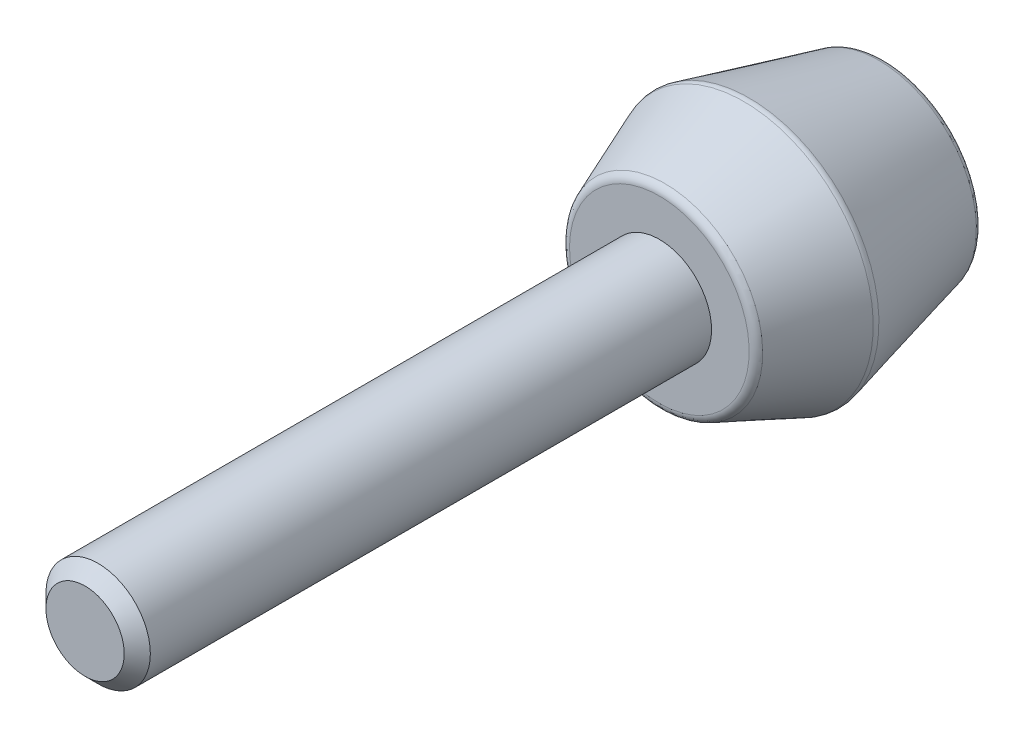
ISO-10303-21;
HEADER;
FILE_DESCRIPTION(('STEP AP214'),'2;1');
FILE_NAME('part.step','',(''),(''),'','','');
FILE_SCHEMA(('AUTOMOTIVE_DESIGN { 1 0 10303 214 1 1 1 1 }'));
ENDSEC;
DATA;
#1=APPLICATION_CONTEXT('core data for automotive mechanical design processes');
#2=APPLICATION_PROTOCOL_DEFINITION('international standard','automotive_design',2000,#1);
#3=PRODUCT_CONTEXT('',#1,'mechanical');
#4=PRODUCT('Part','Part','',(#3));
#5=PRODUCT_RELATED_PRODUCT_CATEGORY('part','',(#4));
#6=PRODUCT_DEFINITION_FORMATION('','',#4);
#7=PRODUCT_DEFINITION_CONTEXT('part definition',#1,'design');
#8=PRODUCT_DEFINITION('design','',#6,#7);
#9=PRODUCT_DEFINITION_SHAPE('','',#8);
#10=(LENGTH_UNIT() NAMED_UNIT(*) SI_UNIT(.MILLI.,.METRE.));
#11=(NAMED_UNIT(*) PLANE_ANGLE_UNIT() SI_UNIT($,.RADIAN.));
#12=(NAMED_UNIT(*) SI_UNIT($,.STERADIAN.) SOLID_ANGLE_UNIT());
#13=UNCERTAINTY_MEASURE_WITH_UNIT(LENGTH_MEASURE(1.E-05),#10,'distance_accuracy_value','');
#14=(GEOMETRIC_REPRESENTATION_CONTEXT(3) GLOBAL_UNCERTAINTY_ASSIGNED_CONTEXT((#13)) GLOBAL_UNIT_ASSIGNED_CONTEXT((#10,
#11,#12)) REPRESENTATION_CONTEXT('',''));
#15=CARTESIAN_POINT('',(0.,0.,0.));
#16=DIRECTION('',(0.,0.,1.));
#17=DIRECTION('',(1.,0.,0.));
#18=AXIS2_PLACEMENT_3D('',#15,#16,#17);
#19=CARTESIAN_POINT('',(0.,0.,2.49999999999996));
#20=DIRECTION('',(0.,0.,1.));
#21=DIRECTION('',(-0.692363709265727,0.72154867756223,0.));
#22=AXIS2_PLACEMENT_3D('',#19,#20,#21);
#23=CYLINDRICAL_SURFACE('',#22,3.);
#24=CARTESIAN_POINT('',(0.,0.,45.25));
#25=DIRECTION('',(0.,0.,1.));
#26=DIRECTION('',(1.,0.,0.));
#27=AXIS2_PLACEMENT_3D('',#24,#25,#26);
#28=CIRCLE('',#27,3.);
#29=CARTESIAN_POINT('',(3.00000000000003,0.,45.25));
#30=VERTEX_POINT('',#29);
#31=EDGE_CURVE('E8',#30,#30,#28,.F.);
#32=ORIENTED_EDGE('',*,*,#31,.T.);
#33=EDGE_LOOP('',(#32));
#34=FACE_BOUND('',#33,.T.);
#35=CARTESIAN_POINT('',(0.,0.,13.));
#36=DIRECTION('',(0.,0.,-1.));
#37=DIRECTION('',(1.,0.,0.));
#38=AXIS2_PLACEMENT_3D('',#35,#36,#37);
#39=CIRCLE('',#38,3.);
#40=CARTESIAN_POINT('',(3.00000000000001,0.,13.));
#41=VERTEX_POINT('',#40);
#42=EDGE_CURVE('E23',#41,#41,#39,.F.);
#43=ORIENTED_EDGE('',*,*,#42,.T.);
#44=EDGE_LOOP('',(#43));
#45=FACE_BOUND('',#44,.T.);
#46=ADVANCED_FACE('F12',(#34,#45),#23,.T.);
#47=CARTESIAN_POINT('',(0.,0.,12.5));
#48=DIRECTION('',(0.,0.,-1.));
#49=DIRECTION('',(0.769107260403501,-0.639119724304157,0.));
#50=AXIS2_PLACEMENT_3D('',#47,#48,#49);
#51=TOROIDAL_SURFACE('',#50,5.16148351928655,0.5);
#52=CARTESIAN_POINT('',(0.,0.,12.685695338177));
#53=DIRECTION('',(0.,0.,-1.));
#54=DIRECTION('',(0.769107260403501,-0.639119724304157,0.));
#55=AXIS2_PLACEMENT_3D('',#52,#53,#54);
#56=CIRCLE('',#55,5.62572186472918);
#57=CARTESIAN_POINT('',(4.32678353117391,-3.59550980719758,12.685695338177));
#58=VERTEX_POINT('',#57);
#59=EDGE_CURVE('E27',#58,#58,#56,.T.);
#60=ORIENTED_EDGE('',*,*,#59,.F.);
#61=EDGE_LOOP('',(#60));
#62=FACE_BOUND('',#61,.T.);
#63=CARTESIAN_POINT('',(0.,0.,13.));
#64=DIRECTION('',(0.,0.,1.));
#65=DIRECTION('',(0.769107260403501,-0.639119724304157,0.));
#66=AXIS2_PLACEMENT_3D('',#63,#64,#65);
#67=CIRCLE('',#66,5.16148351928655);
#68=CARTESIAN_POINT('',(3.96973444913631,-3.29880592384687,13.));
#69=VERTEX_POINT('',#68);
#70=EDGE_CURVE('E36',#69,#69,#67,.T.);
#71=ORIENTED_EDGE('',*,*,#70,.F.);
#72=EDGE_LOOP('',(#71));
#73=FACE_BOUND('',#72,.T.);
#74=ADVANCED_FACE('F59',(#62,#73),#51,.T.);
#75=CARTESIAN_POINT('',(0.,0.,7.96441803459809));
#76=DIRECTION('',(0.,0.,-1.));
#77=DIRECTION('',(0.769107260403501,-0.639119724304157,0.));
#78=AXIS2_PLACEMENT_3D('',#75,#76,#77);
#79=TOROIDAL_SURFACE('',#78,6.97571630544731,0.5);
#80=CARTESIAN_POINT('',(0.,0.,7.84315022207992));
#81=DIRECTION('',(0.,0.,-1.));
#82=DIRECTION('',(0.769107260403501,-0.639119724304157,0.));
#83=AXIS2_PLACEMENT_3D('',#80,#81,#82);
#84=CIRCLE('',#83,7.46078755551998);
#85=CARTESIAN_POINT('',(5.73814587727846,-4.76833648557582,7.84315022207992));
#86=VERTEX_POINT('',#85);
#87=EDGE_CURVE('E30',#86,#86,#84,.T.);
#88=ORIENTED_EDGE('',*,*,#87,.F.);
#89=EDGE_LOOP('',(#88));
#90=FACE_BOUND('',#89,.T.);
#91=CARTESIAN_POINT('',(0.,0.,8.15011337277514));
#92=DIRECTION('',(0.,0.,1.));
#93=DIRECTION('',(-0.769107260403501,0.639119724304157,0.));
#94=AXIS2_PLACEMENT_3D('',#91,#92,#93);
#95=CIRCLE('',#94,7.43995465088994);
#96=CARTESIAN_POINT('',(-5.72212313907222,4.75502176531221,8.15011337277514));
#97=VERTEX_POINT('',#96);
#98=EDGE_CURVE('E46',#97,#97,#95,.T.);
#99=ORIENTED_EDGE('',*,*,#98,.F.);
#100=EDGE_LOOP('',(#99));
#101=FACE_BOUND('',#100,.T.);
#102=ADVANCED_FACE('F62',(#90,#101),#79,.T.);
#103=CARTESIAN_POINT('',(0.,0.,0.5));
#104=DIRECTION('',(0.,0.,-1.));
#105=DIRECTION('',(0.769107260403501,-0.639119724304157,0.));
#106=AXIS2_PLACEMENT_3D('',#103,#104,#105);
#107=TOROIDAL_SURFACE('',#106,5.10961179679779,0.5);
#108=CARTESIAN_POINT('',(0.,0.,0.));
#109=DIRECTION('',(0.,0.,-1.));
#110=DIRECTION('',(0.769107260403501,-0.639119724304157,0.));
#111=AXIS2_PLACEMENT_3D('',#108,#109,#110);
#112=CIRCLE('',#111,5.10961179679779);
#113=CARTESIAN_POINT('',(3.92983953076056,-3.26565368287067,0.));
#114=VERTEX_POINT('',#113);
#115=EDGE_CURVE('E35',#114,#114,#112,.T.);
#116=ORIENTED_EDGE('',*,*,#115,.F.);
#117=EDGE_LOOP('',(#116));
#118=FACE_BOUND('',#117,.T.);
#119=CARTESIAN_POINT('',(0.,0.,0.378732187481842));
#120=DIRECTION('',(0.,0.,1.));
#121=DIRECTION('',(0.769107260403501,-0.639119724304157,0.));
#122=AXIS2_PLACEMENT_3D('',#119,#120,#121);
#123=CIRCLE('',#122,5.59468304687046);
#124=CARTESIAN_POINT('',(4.30291135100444,-3.57567228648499,0.378732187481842));
#125=VERTEX_POINT('',#124);
#126=EDGE_CURVE('E34',#125,#125,#123,.T.);
#127=ORIENTED_EDGE('',*,*,#126,.F.);
#128=EDGE_LOOP('',(#127));
#129=FACE_BOUND('',#128,.T.);
#130=ADVANCED_FACE('F90',(#118,#129),#107,.T.);
#131=CARTESIAN_POINT('',(0.,0.,13.));
#132=DIRECTION('',(0.,0.,-1.));
#133=DIRECTION('',(0.769107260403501,-0.639119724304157,0.));
#134=AXIS2_PLACEMENT_3D('',#131,#132,#133);
#135=CONICAL_SURFACE('',#134,5.5,0.380506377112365);
#136=ORIENTED_EDGE('',*,*,#98,.T.);
#137=EDGE_LOOP('',(#136));
#138=FACE_BOUND('',#137,.T.);
#139=ORIENTED_EDGE('',*,*,#59,.T.);
#140=EDGE_LOOP('',(#139));
#141=FACE_BOUND('',#140,.T.);
#142=ADVANCED_FACE('F57',(#138,#141),#135,.T.);
#143=CARTESIAN_POINT('',(0.,0.,0.));
#144=DIRECTION('',(0.,0.,1.));
#145=DIRECTION('',(-0.769107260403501,0.639119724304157,0.));
#146=AXIS2_PLACEMENT_3D('',#143,#144,#145);
#147=CONICAL_SURFACE('',#146,5.5,0.244978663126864);
#148=ORIENTED_EDGE('',*,*,#87,.T.);
#149=EDGE_LOOP('',(#148));
#150=FACE_BOUND('',#149,.T.);
#151=ORIENTED_EDGE('',*,*,#126,.T.);
#152=EDGE_LOOP('',(#151));
#153=FACE_BOUND('',#152,.T.);
#154=ADVANCED_FACE('F79',(#150,#153),#147,.T.);
#155=CARTESIAN_POINT('',(0.,0.,0.));
#156=DIRECTION('',(0.,0.,-1.));
#157=DIRECTION('',(0.769107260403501,-0.639119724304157,0.));
#158=AXIS2_PLACEMENT_3D('',#155,#156,#157);
#159=PLANE('',#158);
#160=ORIENTED_EDGE('',*,*,#115,.T.);
#161=EDGE_LOOP('',(#160));
#162=FACE_BOUND('',#161,.T.);
#163=ADVANCED_FACE('F69',(#162),#159,.T.);
#164=CARTESIAN_POINT('',(0.,0.,13.));
#165=DIRECTION('',(0.,0.,-1.));
#166=DIRECTION('',(0.769107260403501,-0.639119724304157,0.));
#167=AXIS2_PLACEMENT_3D('',#164,#165,#166);
#168=PLANE('',#167);
#169=ORIENTED_EDGE('',*,*,#42,.F.);
#170=EDGE_LOOP('',(#169));
#171=FACE_BOUND('',#170,.T.);
#172=ORIENTED_EDGE('',*,*,#70,.T.);
#173=EDGE_LOOP('',(#172));
#174=FACE_BOUND('',#173,.T.);
#175=ADVANCED_FACE('F66',(#171,#174),#168,.F.);
#176=CARTESIAN_POINT('',(0.,0.,46.));
#177=DIRECTION('',(0.,0.,1.));
#178=DIRECTION('',(1.,0.,0.));
#179=AXIS2_PLACEMENT_3D('',#176,#177,#178);
#180=PLANE('',#179);
#181=CARTESIAN_POINT('',(0.,0.,46.));
#182=DIRECTION('',(0.,0.,1.));
#183=DIRECTION('',(1.,0.,0.));
#184=AXIS2_PLACEMENT_3D('',#181,#182,#183);
#185=CIRCLE('',#184,2.25);
#186=CARTESIAN_POINT('',(2.25000000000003,0.,46.));
#187=VERTEX_POINT('',#186);
#188=EDGE_CURVE('E19',#187,#187,#185,.T.);
#189=ORIENTED_EDGE('',*,*,#188,.T.);
#190=EDGE_LOOP('',(#189));
#191=FACE_BOUND('',#190,.T.);
#192=ADVANCED_FACE('F68',(#191),#180,.T.);
#193=CARTESIAN_POINT('',(0.,0.,46.));
#194=DIRECTION('',(0.,0.,-1.));
#195=DIRECTION('',(-1.,0.,0.));
#196=AXIS2_PLACEMENT_3D('',#193,#194,#195);
#197=CONICAL_SURFACE('',#196,2.25,0.78539816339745);
#198=ORIENTED_EDGE('',*,*,#31,.F.);
#199=EDGE_LOOP('',(#198));
#200=FACE_BOUND('',#199,.T.);
#201=ORIENTED_EDGE('',*,*,#188,.F.);
#202=EDGE_LOOP('',(#201));
#203=FACE_BOUND('',#202,.T.);
#204=ADVANCED_FACE('F14',(#200,#203),#197,.T.);
#205=CLOSED_SHELL('',(#46,#74,#102,#130,#142,#154,#163,#175,#192,#204));
#206=MANIFOLD_SOLID_BREP('B1',#205);
#207=ADVANCED_BREP_SHAPE_REPRESENTATION('',(#18,#206),#14);
#208=SHAPE_DEFINITION_REPRESENTATION(#9,#207);
ENDSEC;
END-ISO-10303-21;
